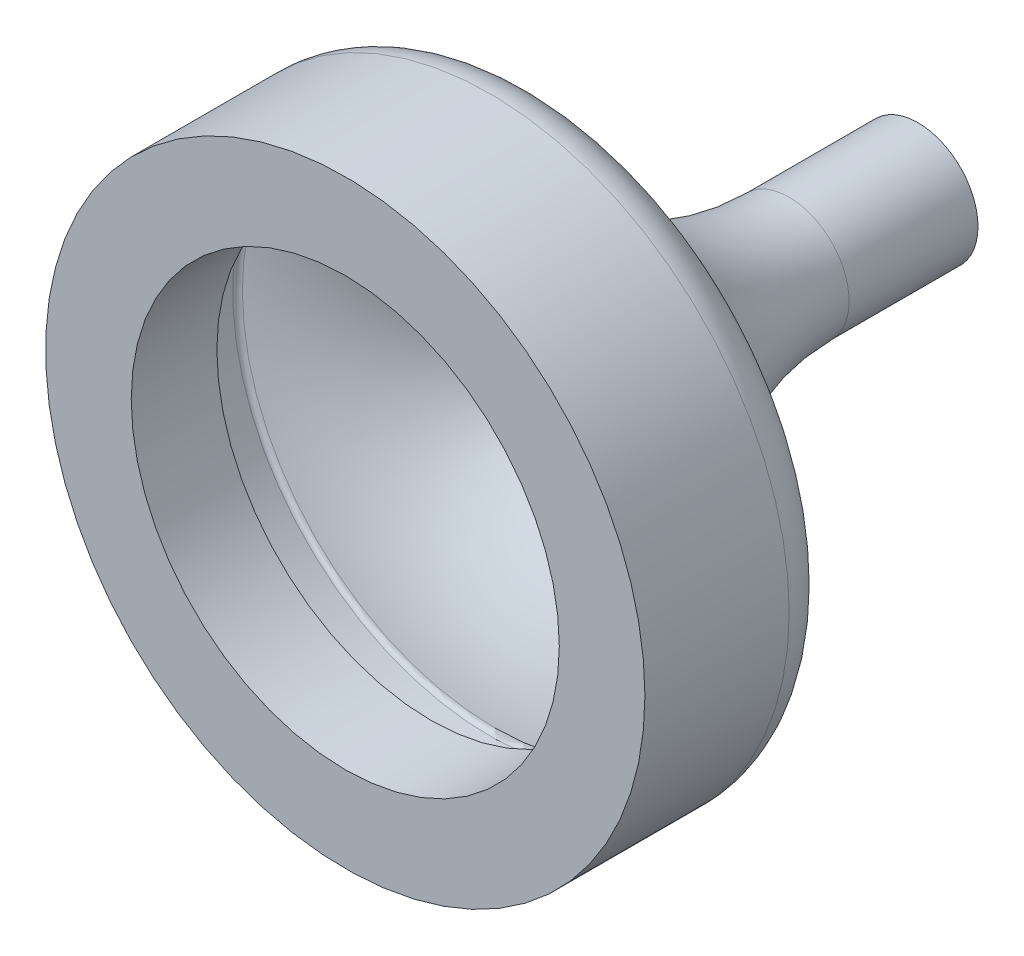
ISO-10303-21;
HEADER;
FILE_DESCRIPTION(('STEP AP214'),'2;1');
FILE_NAME('part.step','',(''),(''),'','','');
FILE_SCHEMA(('AUTOMOTIVE_DESIGN { 1 0 10303 214 1 1 1 1 }'));
ENDSEC;
DATA;
#1=APPLICATION_CONTEXT('core data for automotive mechanical design processes');
#2=APPLICATION_PROTOCOL_DEFINITION('international standard','automotive_design',2000,#1);
#3=PRODUCT_CONTEXT('',#1,'mechanical');
#4=PRODUCT('Part','Part','',(#3));
#5=PRODUCT_RELATED_PRODUCT_CATEGORY('part','',(#4));
#6=PRODUCT_DEFINITION_FORMATION('','',#4);
#7=PRODUCT_DEFINITION_CONTEXT('part definition',#1,'design');
#8=PRODUCT_DEFINITION('design','',#6,#7);
#9=PRODUCT_DEFINITION_SHAPE('','',#8);
#10=(LENGTH_UNIT() NAMED_UNIT(*) SI_UNIT(.MILLI.,.METRE.));
#11=(NAMED_UNIT(*) PLANE_ANGLE_UNIT() SI_UNIT($,.RADIAN.));
#12=(NAMED_UNIT(*) SI_UNIT($,.STERADIAN.) SOLID_ANGLE_UNIT());
#13=UNCERTAINTY_MEASURE_WITH_UNIT(LENGTH_MEASURE(1.E-05),#10,'distance_accuracy_value','');
#14=(GEOMETRIC_REPRESENTATION_CONTEXT(3) GLOBAL_UNCERTAINTY_ASSIGNED_CONTEXT((#13)) GLOBAL_UNIT_ASSIGNED_CONTEXT((#10,
#11,#12)) REPRESENTATION_CONTEXT('',''));
#15=CARTESIAN_POINT('',(0.,0.,0.));
#16=DIRECTION('',(0.,0.,1.));
#17=DIRECTION('',(1.,0.,0.));
#18=AXIS2_PLACEMENT_3D('',#15,#16,#17);
#19=CARTESIAN_POINT('',(0.,0.,0.));
#20=DIRECTION('',(0.,0.,1.));
#21=DIRECTION('',(1.,0.,0.));
#22=AXIS2_PLACEMENT_3D('',#19,#20,#21);
#23=PLANE('',#22);
#24=CARTESIAN_POINT('',(0.,0.,0.));
#25=DIRECTION('',(0.,0.,1.));
#26=DIRECTION('',(1.,0.,0.));
#27=AXIS2_PLACEMENT_3D('',#24,#25,#26);
#28=CIRCLE('',#27,12.5);
#29=CARTESIAN_POINT('',(12.5,0.,0.));
#30=VERTEX_POINT('',#29);
#31=EDGE_CURVE('E44',#30,#30,#28,.T.);
#32=ORIENTED_EDGE('',*,*,#31,.T.);
#33=EDGE_LOOP('',(#32));
#34=FACE_BOUND('',#33,.T.);
#35=CARTESIAN_POINT('',(0.,0.,0.));
#36=DIRECTION('',(0.,0.,1.));
#37=DIRECTION('',(1.,0.,0.));
#38=AXIS2_PLACEMENT_3D('',#35,#36,#37);
#39=CIRCLE('',#38,15.);
#40=CARTESIAN_POINT('',(15.,0.,0.));
#41=VERTEX_POINT('',#40);
#42=EDGE_CURVE('E10',#41,#41,#39,.T.);
#43=ORIENTED_EDGE('',*,*,#42,.F.);
#44=EDGE_LOOP('',(#43));
#45=FACE_BOUND('',#44,.T.);
#46=ADVANCED_FACE('F29',(#34,#45),#23,.F.);
#47=CARTESIAN_POINT('',(0.,0.,5.));
#48=DIRECTION('',(0.,0.,1.));
#49=DIRECTION('',(1.,0.,0.));
#50=AXIS2_PLACEMENT_3D('',#47,#48,#49);
#51=PLANE('',#50);
#52=CARTESIAN_POINT('',(0.,0.,5.));
#53=DIRECTION('',(0.,0.,1.));
#54=DIRECTION('',(1.,0.,0.));
#55=AXIS2_PLACEMENT_3D('',#52,#53,#54);
#56=CIRCLE('',#55,17.5);
#57=CARTESIAN_POINT('',(17.5,0.,5.));
#58=VERTEX_POINT('',#57);
#59=EDGE_CURVE('E36',#58,#58,#56,.T.);
#60=ORIENTED_EDGE('',*,*,#59,.T.);
#61=EDGE_LOOP('',(#60));
#62=FACE_BOUND('',#61,.T.);
#63=CARTESIAN_POINT('',(0.,0.,5.));
#64=DIRECTION('',(0.,0.,1.));
#65=DIRECTION('',(1.,0.,0.));
#66=AXIS2_PLACEMENT_3D('',#63,#64,#65);
#67=CIRCLE('',#66,12.5);
#68=CARTESIAN_POINT('',(12.5,0.,5.));
#69=VERTEX_POINT('',#68);
#70=EDGE_CURVE('E40',#69,#69,#67,.T.);
#71=ORIENTED_EDGE('',*,*,#70,.F.);
#72=EDGE_LOOP('',(#71));
#73=FACE_BOUND('',#72,.T.);
#74=ADVANCED_FACE('F127',(#62,#73),#51,.T.);
#75=CARTESIAN_POINT('',(0.,0.,5.));
#76=DIRECTION('',(0.,0.,-1.));
#77=DIRECTION('',(-1.,0.,0.));
#78=AXIS2_PLACEMENT_3D('',#75,#76,#77);
#79=CYLINDRICAL_SURFACE('',#78,17.5);
#80=ORIENTED_EDGE('',*,*,#59,.F.);
#81=EDGE_LOOP('',(#80));
#82=FACE_BOUND('',#81,.T.);
#83=CARTESIAN_POINT('',(0.,0.,-3.42584586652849));
#84=DIRECTION('',(0.,0.,1.));
#85=DIRECTION('',(1.,0.,0.));
#86=AXIS2_PLACEMENT_3D('',#83,#84,#85);
#87=CIRCLE('',#86,17.5);
#88=CARTESIAN_POINT('',(17.5,0.,-3.42584586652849));
#89=VERTEX_POINT('',#88);
#90=EDGE_CURVE('E70',#89,#89,#87,.T.);
#91=ORIENTED_EDGE('',*,*,#90,.T.);
#92=EDGE_LOOP('',(#91));
#93=FACE_BOUND('',#92,.T.);
#94=ADVANCED_FACE('F31',(#82,#93),#79,.T.);
#95=CARTESIAN_POINT('',(0.,0.,5.));
#96=DIRECTION('',(0.,0.,-1.));
#97=DIRECTION('',(-1.,0.,0.));
#98=AXIS2_PLACEMENT_3D('',#95,#96,#97);
#99=CYLINDRICAL_SURFACE('',#98,12.5);
#100=ORIENTED_EDGE('',*,*,#70,.T.);
#101=EDGE_LOOP('',(#100));
#102=FACE_BOUND('',#101,.T.);
#103=ORIENTED_EDGE('',*,*,#31,.F.);
#104=EDGE_LOOP('',(#103));
#105=FACE_BOUND('',#104,.T.);
#106=ADVANCED_FACE('F119',(#102,#105),#99,.F.);
#107=CARTESIAN_POINT('',(0.,0.,0.));
#108=DIRECTION('',(0.,0.,1.));
#109=DIRECTION('',(1.,0.,0.));
#110=AXIS2_PLACEMENT_3D('',#107,#108,#109);
#111=CYLINDRICAL_SURFACE('',#110,15.);
#112=CARTESIAN_POINT('',(0.,0.,-3.42584586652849));
#113=DIRECTION('',(0.,0.,1.));
#114=DIRECTION('',(1.,0.,0.));
#115=AXIS2_PLACEMENT_3D('',#112,#113,#114);
#116=CIRCLE('',#115,15.);
#117=CARTESIAN_POINT('',(15.,0.,-3.42584586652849));
#118=VERTEX_POINT('',#117);
#119=EDGE_CURVE('E48',#118,#118,#116,.T.);
#120=ORIENTED_EDGE('',*,*,#119,.F.);
#121=EDGE_LOOP('',(#120));
#122=FACE_BOUND('',#121,.T.);
#123=ORIENTED_EDGE('',*,*,#42,.T.);
#124=EDGE_LOOP('',(#123));
#125=FACE_BOUND('',#124,.T.);
#126=ADVANCED_FACE('F114',(#122,#125),#111,.F.);
#127=CARTESIAN_POINT('',(0.,0.,-3.42584586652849));
#128=DIRECTION('',(0.,0.,1.));
#129=DIRECTION('',(1.,0.,0.));
#130=AXIS2_PLACEMENT_3D('',#127,#128,#129);
#131=TOROIDAL_SURFACE('',#130,14.6798122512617,0.320187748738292);
#132=CARTESIAN_POINT('',(0.,0.,-3.73824259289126));
#133=DIRECTION('',(0.,0.,1.));
#134=DIRECTION('',(1.,0.,0.));
#135=AXIS2_PLACEMENT_3D('',#132,#133,#134);
#136=CIRCLE('',#135,14.7500153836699);
#137=CARTESIAN_POINT('',(14.7500153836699,0.,-3.73824259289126));
#138=VERTEX_POINT('',#137);
#139=EDGE_CURVE('E52',#138,#138,#136,.T.);
#140=ORIENTED_EDGE('',*,*,#139,.F.);
#141=EDGE_LOOP('',(#140));
#142=FACE_BOUND('',#141,.T.);
#143=ORIENTED_EDGE('',*,*,#119,.T.);
#144=EDGE_LOOP('',(#143));
#145=FACE_BOUND('',#144,.T.);
#146=ADVANCED_FACE('F108',(#142,#145),#131,.F.);
#147=CARTESIAN_POINT('',(0.,0.,-20.9211391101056));
#148=DIRECTION('',(0.,0.,1.));
#149=DIRECTION('',(1.,0.,0.));
#150=AXIS2_PLACEMENT_3D('',#147,#148,#149);
#151=TOROIDAL_SURFACE('',#150,18.6114295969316,17.6114295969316);
#152=CARTESIAN_POINT('',(0.,0.,-20.9211391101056));
#153=DIRECTION('',(0.,0.,1.));
#154=DIRECTION('',(1.,0.,0.));
#155=AXIS2_PLACEMENT_3D('',#152,#153,#154);
#156=CIRCLE('',#155,1.);
#157=CARTESIAN_POINT('',(1.,0.,-20.9211391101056));
#158=VERTEX_POINT('',#157);
#159=EDGE_CURVE('E55',#158,#158,#156,.T.);
#160=ORIENTED_EDGE('',*,*,#159,.F.);
#161=EDGE_LOOP('',(#160));
#162=FACE_BOUND('',#161,.T.);
#163=ORIENTED_EDGE('',*,*,#139,.T.);
#164=EDGE_LOOP('',(#163));
#165=FACE_BOUND('',#164,.T.);
#166=ADVANCED_FACE('F102',(#162,#165),#151,.T.);
#167=CARTESIAN_POINT('',(0.,0.,0.));
#168=DIRECTION('',(0.,0.,1.));
#169=DIRECTION('',(1.,0.,0.));
#170=AXIS2_PLACEMENT_3D('',#167,#168,#169);
#171=CYLINDRICAL_SURFACE('',#170,1.);
#172=CARTESIAN_POINT('',(0.,0.,-28.45));
#173=DIRECTION('',(0.,0.,1.));
#174=DIRECTION('',(1.,0.,0.));
#175=AXIS2_PLACEMENT_3D('',#172,#173,#174);
#176=CIRCLE('',#175,1.);
#177=CARTESIAN_POINT('',(1.,0.,-28.45));
#178=VERTEX_POINT('',#177);
#179=EDGE_CURVE('E58',#178,#178,#176,.T.);
#180=ORIENTED_EDGE('',*,*,#179,.F.);
#181=EDGE_LOOP('',(#180));
#182=FACE_BOUND('',#181,.T.);
#183=ORIENTED_EDGE('',*,*,#159,.T.);
#184=EDGE_LOOP('',(#183));
#185=FACE_BOUND('',#184,.T.);
#186=ADVANCED_FACE('F96',(#182,#185),#171,.F.);
#187=CARTESIAN_POINT('',(-3.5,0.,-28.45));
#188=DIRECTION('',(0.,0.,1.));
#189=DIRECTION('',(1.,0.,0.));
#190=AXIS2_PLACEMENT_3D('',#187,#188,#189);
#191=PLANE('',#190);
#192=CARTESIAN_POINT('',(0.,0.,-28.45));
#193=DIRECTION('',(0.,0.,1.));
#194=DIRECTION('',(1.,0.,0.));
#195=AXIS2_PLACEMENT_3D('',#192,#193,#194);
#196=CIRCLE('',#195,3.5);
#197=CARTESIAN_POINT('',(3.5,0.,-28.45));
#198=VERTEX_POINT('',#197);
#199=EDGE_CURVE('E61',#198,#198,#196,.T.);
#200=ORIENTED_EDGE('',*,*,#199,.F.);
#201=EDGE_LOOP('',(#200));
#202=FACE_BOUND('',#201,.T.);
#203=ORIENTED_EDGE('',*,*,#179,.T.);
#204=EDGE_LOOP('',(#203));
#205=FACE_BOUND('',#204,.T.);
#206=ADVANCED_FACE('F90',(#202,#205),#191,.F.);
#207=CARTESIAN_POINT('',(0.,0.,0.));
#208=DIRECTION('',(0.,0.,1.));
#209=DIRECTION('',(1.,0.,0.));
#210=AXIS2_PLACEMENT_3D('',#207,#208,#209);
#211=CYLINDRICAL_SURFACE('',#210,3.5);
#212=CARTESIAN_POINT('',(0.,0.,-20.9211391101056));
#213=DIRECTION('',(0.,0.,1.));
#214=DIRECTION('',(1.,0.,0.));
#215=AXIS2_PLACEMENT_3D('',#212,#213,#214);
#216=CIRCLE('',#215,3.5);
#217=CARTESIAN_POINT('',(3.5,0.,-20.9211391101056));
#218=VERTEX_POINT('',#217);
#219=EDGE_CURVE('E64',#218,#218,#216,.T.);
#220=ORIENTED_EDGE('',*,*,#219,.F.);
#221=EDGE_LOOP('',(#220));
#222=FACE_BOUND('',#221,.T.);
#223=ORIENTED_EDGE('',*,*,#199,.T.);
#224=EDGE_LOOP('',(#223));
#225=FACE_BOUND('',#224,.T.);
#226=ADVANCED_FACE('F84',(#222,#225),#211,.T.);
#227=CARTESIAN_POINT('',(0.,0.,-20.9211391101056));
#228=DIRECTION('',(0.,0.,1.));
#229=DIRECTION('',(1.,0.,0.));
#230=AXIS2_PLACEMENT_3D('',#227,#228,#229);
#231=TOROIDAL_SURFACE('',#230,18.6114295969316,15.1114295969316);
#232=CARTESIAN_POINT('',(0.,0.,-6.17741092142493));
#233=DIRECTION('',(0.,0.,1.));
#234=DIRECTION('',(1.,0.,0.));
#235=AXIS2_PLACEMENT_3D('',#232,#233,#234);
#236=CIRCLE('',#235,15.2981557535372);
#237=CARTESIAN_POINT('',(15.2981557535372,0.,-6.17741092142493));
#238=VERTEX_POINT('',#237);
#239=EDGE_CURVE('E67',#238,#238,#236,.T.);
#240=ORIENTED_EDGE('',*,*,#239,.F.);
#241=EDGE_LOOP('',(#240));
#242=FACE_BOUND('',#241,.T.);
#243=ORIENTED_EDGE('',*,*,#219,.T.);
#244=EDGE_LOOP('',(#243));
#245=FACE_BOUND('',#244,.T.);
#246=ADVANCED_FACE('F78',(#242,#245),#231,.F.);
#247=CARTESIAN_POINT('',(0.,0.,-3.42584586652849));
#248=DIRECTION('',(0.,0.,1.));
#249=DIRECTION('',(1.,0.,0.));
#250=AXIS2_PLACEMENT_3D('',#247,#248,#249);
#251=TOROIDAL_SURFACE('',#250,14.6798122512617,2.82018774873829);
#252=ORIENTED_EDGE('',*,*,#90,.F.);
#253=EDGE_LOOP('',(#252));
#254=FACE_BOUND('',#253,.T.);
#255=ORIENTED_EDGE('',*,*,#239,.T.);
#256=EDGE_LOOP('',(#255));
#257=FACE_BOUND('',#256,.T.);
#258=ADVANCED_FACE('F75',(#254,#257),#251,.T.);
#259=CLOSED_SHELL('',(#46,#74,#94,#106,#126,#146,#166,#186,#206,#226,#246,#258));
#260=MANIFOLD_SOLID_BREP('B2',#259);
#261=ADVANCED_BREP_SHAPE_REPRESENTATION('',(#18,#260),#14);
#262=SHAPE_DEFINITION_REPRESENTATION(#9,#261);
ENDSEC;
END-ISO-10303-21;
